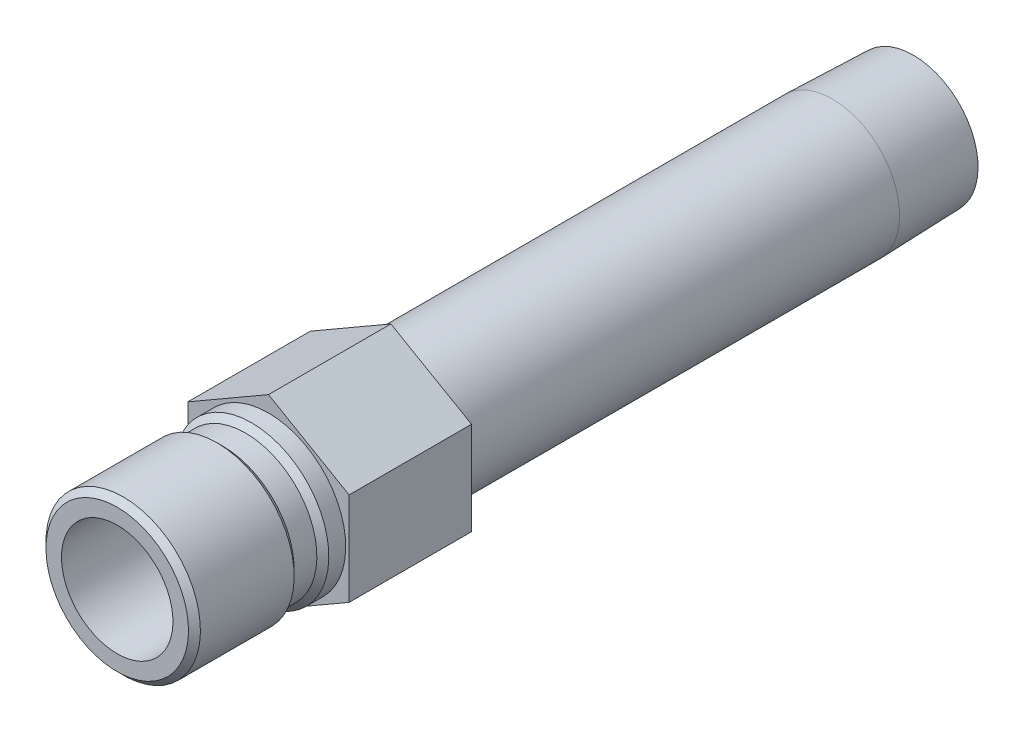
ISO-10303-21;
HEADER;
FILE_DESCRIPTION(('STEP AP214'),'2;1');
FILE_NAME('part.step','',(''),(''),'','','');
FILE_SCHEMA(('AUTOMOTIVE_DESIGN { 1 0 10303 214 1 1 1 1 }'));
ENDSEC;
DATA;
#1=APPLICATION_CONTEXT('core data for automotive mechanical design processes');
#2=APPLICATION_PROTOCOL_DEFINITION('international standard','automotive_design',2000,#1);
#3=PRODUCT_CONTEXT('',#1,'mechanical');
#4=PRODUCT('Part','Part','',(#3));
#5=PRODUCT_RELATED_PRODUCT_CATEGORY('part','',(#4));
#6=PRODUCT_DEFINITION_FORMATION('','',#4);
#7=PRODUCT_DEFINITION_CONTEXT('part definition',#1,'design');
#8=PRODUCT_DEFINITION('design','',#6,#7);
#9=PRODUCT_DEFINITION_SHAPE('','',#8);
#10=(LENGTH_UNIT() NAMED_UNIT(*) SI_UNIT(.MILLI.,.METRE.));
#11=(NAMED_UNIT(*) PLANE_ANGLE_UNIT() SI_UNIT($,.RADIAN.));
#12=(NAMED_UNIT(*) SI_UNIT($,.STERADIAN.) SOLID_ANGLE_UNIT());
#13=UNCERTAINTY_MEASURE_WITH_UNIT(LENGTH_MEASURE(1.E-05),#10,'distance_accuracy_value','');
#14=(GEOMETRIC_REPRESENTATION_CONTEXT(3) GLOBAL_UNCERTAINTY_ASSIGNED_CONTEXT((#13)) GLOBAL_UNIT_ASSIGNED_CONTEXT((#10,
#11,#12)) REPRESENTATION_CONTEXT('',''));
#15=CARTESIAN_POINT('',(0.,0.,0.));
#16=DIRECTION('',(0.,0.,1.));
#17=DIRECTION('',(1.,0.,0.));
#18=AXIS2_PLACEMENT_3D('',#15,#16,#17);
#19=CARTESIAN_POINT('',(0.,0.,0.));
#20=DIRECTION('',(0.,0.,-1.));
#21=DIRECTION('',(0.,1.,0.));
#22=AXIS2_PLACEMENT_3D('',#19,#20,#21);
#23=CYLINDRICAL_SURFACE('',#22,8.5725);
#24=CARTESIAN_POINT('',(0.,0.,-71.9582));
#25=DIRECTION('',(0.,0.,-1.));
#26=DIRECTION('',(0.,1.,0.));
#27=AXIS2_PLACEMENT_3D('',#24,#25,#26);
#28=CIRCLE('',#27,8.5725);
#29=CARTESIAN_POINT('',(0.,8.5725,-71.9582));
#30=VERTEX_POINT('',#29);
#31=EDGE_CURVE('E158',#30,#30,#28,.T.);
#32=ORIENTED_EDGE('',*,*,#31,.F.);
#33=EDGE_LOOP('',(#32));
#34=FACE_BOUND('',#33,.T.);
#35=CARTESIAN_POINT('',(0.,0.,-15.621));
#36=DIRECTION('',(0.,0.,1.));
#37=DIRECTION('',(1.,0.,0.));
#38=AXIS2_PLACEMENT_3D('',#35,#36,#37);
#39=CIRCLE('',#38,8.5725);
#40=CARTESIAN_POINT('',(8.5725,0.,-15.621));
#41=VERTEX_POINT('',#40);
#42=EDGE_CURVE('E39',#41,#41,#39,.F.);
#43=ORIENTED_EDGE('',*,*,#42,.T.);
#44=EDGE_LOOP('',(#43));
#45=FACE_BOUND('',#44,.T.);
#46=ADVANCED_FACE('F35',(#34,#45),#23,.T.);
#47=CARTESIAN_POINT('',(0.,0.,0.));
#48=DIRECTION('',(0.,0.,-1.));
#49=DIRECTION('',(0.,1.,0.));
#50=AXIS2_PLACEMENT_3D('',#47,#48,#49);
#51=CYLINDRICAL_SURFACE('',#50,7.112);
#52=CARTESIAN_POINT('',(0.,0.,1.524));
#53=DIRECTION('',(0.,0.,-1.));
#54=DIRECTION('',(0.,1.,0.));
#55=AXIS2_PLACEMENT_3D('',#52,#53,#54);
#56=CIRCLE('',#55,7.112);
#57=CARTESIAN_POINT('',(0.,7.112,1.524));
#58=VERTEX_POINT('',#57);
#59=EDGE_CURVE('E146',#58,#58,#56,.T.);
#60=ORIENTED_EDGE('',*,*,#59,.T.);
#61=EDGE_LOOP('',(#60));
#62=FACE_BOUND('',#61,.T.);
#63=CARTESIAN_POINT('',(0.,0.,19.304));
#64=DIRECTION('',(0.,0.,-1.));
#65=DIRECTION('',(0.,1.,0.));
#66=AXIS2_PLACEMENT_3D('',#63,#64,#65);
#67=CIRCLE('',#66,7.112);
#68=CARTESIAN_POINT('',(0.,7.112,19.304));
#69=VERTEX_POINT('',#68);
#70=EDGE_CURVE('E11',#69,#69,#67,.T.);
#71=ORIENTED_EDGE('',*,*,#70,.F.);
#72=EDGE_LOOP('',(#71));
#73=FACE_BOUND('',#72,.T.);
#74=ADVANCED_FACE('F37',(#62,#73),#51,.F.);
#75=CARTESIAN_POINT('',(0.,7.112,19.304));
#76=DIRECTION('',(0.,0.,1.));
#77=DIRECTION('',(0.,-1.,0.));
#78=AXIS2_PLACEMENT_3D('',#75,#76,#77);
#79=PLANE('',#78);
#80=ORIENTED_EDGE('',*,*,#70,.T.);
#81=EDGE_LOOP('',(#80));
#82=FACE_BOUND('',#81,.T.);
#83=CARTESIAN_POINT('',(0.,0.,19.304));
#84=DIRECTION('',(0.,0.,-1.));
#85=DIRECTION('',(0.,1.,0.));
#86=AXIS2_PLACEMENT_3D('',#83,#84,#85);
#87=CIRCLE('',#86,9.09319999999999);
#88=CARTESIAN_POINT('',(0.,9.0932,19.304));
#89=VERTEX_POINT('',#88);
#90=EDGE_CURVE('E45',#89,#89,#87,.T.);
#91=ORIENTED_EDGE('',*,*,#90,.F.);
#92=EDGE_LOOP('',(#91));
#93=FACE_BOUND('',#92,.T.);
#94=ADVANCED_FACE('F185',(#82,#93),#79,.T.);
#95=CARTESIAN_POINT('',(0.,0.,18.542));
#96=DIRECTION('',(0.,0.,-1.));
#97=DIRECTION('',(0.,1.,0.));
#98=AXIS2_PLACEMENT_3D('',#95,#96,#97);
#99=CONICAL_SURFACE('',#98,9.8552,0.785398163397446);
#100=ORIENTED_EDGE('',*,*,#90,.T.);
#101=EDGE_LOOP('',(#100));
#102=FACE_BOUND('',#101,.T.);
#103=CARTESIAN_POINT('',(0.,0.,18.542));
#104=DIRECTION('',(0.,0.,-1.));
#105=DIRECTION('',(0.,1.,0.));
#106=AXIS2_PLACEMENT_3D('',#103,#104,#105);
#107=CIRCLE('',#106,9.8552);
#108=CARTESIAN_POINT('',(0.,9.8552,18.542));
#109=VERTEX_POINT('',#108);
#110=EDGE_CURVE('E176',#109,#109,#107,.T.);
#111=ORIENTED_EDGE('',*,*,#110,.F.);
#112=EDGE_LOOP('',(#111));
#113=FACE_BOUND('',#112,.T.);
#114=ADVANCED_FACE('F182',(#102,#113),#99,.T.);
#115=CARTESIAN_POINT('',(0.,0.,0.));
#116=DIRECTION('',(0.,0.,-1.));
#117=DIRECTION('',(0.,1.,0.));
#118=AXIS2_PLACEMENT_3D('',#115,#116,#117);
#119=CYLINDRICAL_SURFACE('',#118,9.8552);
#120=ORIENTED_EDGE('',*,*,#110,.T.);
#121=EDGE_LOOP('',(#120));
#122=FACE_BOUND('',#121,.T.);
#123=CARTESIAN_POINT('',(0.,0.,6.5786));
#124=DIRECTION('',(0.,0.,-1.));
#125=DIRECTION('',(0.,1.,0.));
#126=AXIS2_PLACEMENT_3D('',#123,#124,#125);
#127=CIRCLE('',#126,9.8552);
#128=CARTESIAN_POINT('',(0.,9.8552,6.5786));
#129=VERTEX_POINT('',#128);
#130=EDGE_CURVE('E173',#129,#129,#127,.T.);
#131=ORIENTED_EDGE('',*,*,#130,.F.);
#132=EDGE_LOOP('',(#131));
#133=FACE_BOUND('',#132,.T.);
#134=ADVANCED_FACE('F192',(#122,#133),#119,.T.);
#135=CARTESIAN_POINT('',(0.,0.,5.8166));
#136=DIRECTION('',(0.,0.,1.));
#137=DIRECTION('',(0.,-1.,0.));
#138=AXIS2_PLACEMENT_3D('',#135,#136,#137);
#139=CONICAL_SURFACE('',#138,9.0932,0.785398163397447);
#140=ORIENTED_EDGE('',*,*,#130,.T.);
#141=EDGE_LOOP('',(#140));
#142=FACE_BOUND('',#141,.T.);
#143=CARTESIAN_POINT('',(0.,0.,5.8166));
#144=DIRECTION('',(0.,0.,-1.));
#145=DIRECTION('',(0.,1.,0.));
#146=AXIS2_PLACEMENT_3D('',#143,#144,#145);
#147=CIRCLE('',#146,9.0932);
#148=CARTESIAN_POINT('',(0.,9.0932,5.8166));
#149=VERTEX_POINT('',#148);
#150=EDGE_CURVE('E170',#149,#149,#147,.T.);
#151=ORIENTED_EDGE('',*,*,#150,.F.);
#152=EDGE_LOOP('',(#151));
#153=FACE_BOUND('',#152,.T.);
#154=ADVANCED_FACE('F217',(#142,#153),#139,.T.);
#155=CARTESIAN_POINT('',(0.,0.,0.));
#156=DIRECTION('',(0.,0.,-1.));
#157=DIRECTION('',(0.,1.,0.));
#158=AXIS2_PLACEMENT_3D('',#155,#156,#157);
#159=CYLINDRICAL_SURFACE('',#158,9.0932);
#160=ORIENTED_EDGE('',*,*,#150,.T.);
#161=EDGE_LOOP('',(#160));
#162=FACE_BOUND('',#161,.T.);
#163=CARTESIAN_POINT('',(0.,0.,2.921));
#164=DIRECTION('',(0.,0.,-1.));
#165=DIRECTION('',(0.,1.,0.));
#166=AXIS2_PLACEMENT_3D('',#163,#164,#165);
#167=CIRCLE('',#166,9.0932);
#168=CARTESIAN_POINT('',(0.,9.0932,2.921));
#169=VERTEX_POINT('',#168);
#170=EDGE_CURVE('E167',#169,#169,#167,.T.);
#171=ORIENTED_EDGE('',*,*,#170,.F.);
#172=EDGE_LOOP('',(#171));
#173=FACE_BOUND('',#172,.T.);
#174=ADVANCED_FACE('F213',(#162,#173),#159,.T.);
#175=CARTESIAN_POINT('',(0.,0.,2.159));
#176=DIRECTION('',(0.,0.,-1.));
#177=DIRECTION('',(0.,1.,0.));
#178=AXIS2_PLACEMENT_3D('',#175,#176,#177);
#179=CONICAL_SURFACE('',#178,9.8552,0.785398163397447);
#180=ORIENTED_EDGE('',*,*,#170,.T.);
#181=EDGE_LOOP('',(#180));
#182=FACE_BOUND('',#181,.T.);
#183=CARTESIAN_POINT('',(0.,0.,2.159));
#184=DIRECTION('',(0.,0.,-1.));
#185=DIRECTION('',(0.,1.,0.));
#186=AXIS2_PLACEMENT_3D('',#183,#184,#185);
#187=CIRCLE('',#186,9.8552);
#188=CARTESIAN_POINT('',(0.,9.8552,2.159));
#189=VERTEX_POINT('',#188);
#190=EDGE_CURVE('E164',#189,#189,#187,.T.);
#191=ORIENTED_EDGE('',*,*,#190,.F.);
#192=EDGE_LOOP('',(#191));
#193=FACE_BOUND('',#192,.T.);
#194=ADVANCED_FACE('F209',(#182,#193),#179,.T.);
#195=CARTESIAN_POINT('',(0.,0.,0.));
#196=DIRECTION('',(0.,0.,-1.));
#197=DIRECTION('',(0.,1.,0.));
#198=AXIS2_PLACEMENT_3D('',#195,#196,#197);
#199=CYLINDRICAL_SURFACE('',#198,9.8552);
#200=ORIENTED_EDGE('',*,*,#190,.T.);
#201=EDGE_LOOP('',(#200));
#202=FACE_BOUND('',#201,.T.);
#203=CARTESIAN_POINT('',(0.,0.,0.));
#204=DIRECTION('',(0.,0.,-1.));
#205=DIRECTION('',(0.,1.,0.));
#206=AXIS2_PLACEMENT_3D('',#203,#204,#205);
#207=CIRCLE('',#206,9.8552);
#208=CARTESIAN_POINT('',(0.,9.8552,0.));
#209=VERTEX_POINT('',#208);
#210=EDGE_CURVE('E161',#209,#209,#207,.T.);
#211=ORIENTED_EDGE('',*,*,#210,.F.);
#212=EDGE_LOOP('',(#211));
#213=FACE_BOUND('',#212,.T.);
#214=ADVANCED_FACE('F206',(#202,#213),#199,.T.);
#215=CARTESIAN_POINT('',(0.,0.,-82.296));
#216=DIRECTION('',(0.,0.,1.));
#217=DIRECTION('',(0.,-1.,0.));
#218=AXIS2_PLACEMENT_3D('',#215,#216,#217);
#219=CONICAL_SURFACE('',#218,8.24944566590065,0.0312396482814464);
#220=ORIENTED_EDGE('',*,*,#31,.T.);
#221=EDGE_LOOP('',(#220));
#222=FACE_BOUND('',#221,.T.);
#223=CARTESIAN_POINT('',(0.,0.,-82.296));
#224=DIRECTION('',(0.,0.,-1.));
#225=DIRECTION('',(0.,1.,0.));
#226=AXIS2_PLACEMENT_3D('',#223,#224,#225);
#227=CIRCLE('',#226,8.24944566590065);
#228=CARTESIAN_POINT('',(0.,8.24944566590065,-82.296));
#229=VERTEX_POINT('',#228);
#230=EDGE_CURVE('E155',#229,#229,#227,.T.);
#231=ORIENTED_EDGE('',*,*,#230,.F.);
#232=EDGE_LOOP('',(#231));
#233=FACE_BOUND('',#232,.T.);
#234=ADVANCED_FACE('F204',(#222,#233),#219,.T.);
#235=CARTESIAN_POINT('',(0.,8.24944566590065,-82.296));
#236=DIRECTION('',(0.,0.,-1.));
#237=DIRECTION('',(0.,1.,0.));
#238=AXIS2_PLACEMENT_3D('',#235,#236,#237);
#239=PLANE('',#238);
#240=ORIENTED_EDGE('',*,*,#230,.T.);
#241=EDGE_LOOP('',(#240));
#242=FACE_BOUND('',#241,.T.);
#243=CARTESIAN_POINT('',(0.,0.,-82.296));
#244=DIRECTION('',(0.,0.,-1.));
#245=DIRECTION('',(0.,1.,0.));
#246=AXIS2_PLACEMENT_3D('',#243,#244,#245);
#247=CIRCLE('',#246,6.2611);
#248=CARTESIAN_POINT('',(0.,6.2611,-82.296));
#249=VERTEX_POINT('',#248);
#250=EDGE_CURVE('E152',#249,#249,#247,.T.);
#251=ORIENTED_EDGE('',*,*,#250,.F.);
#252=EDGE_LOOP('',(#251));
#253=FACE_BOUND('',#252,.T.);
#254=ADVANCED_FACE('F270',(#242,#253),#239,.T.);
#255=CARTESIAN_POINT('',(0.,0.,0.));
#256=DIRECTION('',(0.,0.,-1.));
#257=DIRECTION('',(0.,1.,0.));
#258=AXIS2_PLACEMENT_3D('',#255,#256,#257);
#259=CYLINDRICAL_SURFACE('',#258,6.2611);
#260=ORIENTED_EDGE('',*,*,#250,.T.);
#261=EDGE_LOOP('',(#260));
#262=FACE_BOUND('',#261,.T.);
#263=CARTESIAN_POINT('',(0.,0.,1.07156844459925));
#264=DIRECTION('',(0.,0.,-1.));
#265=DIRECTION('',(0.,1.,0.));
#266=AXIS2_PLACEMENT_3D('',#263,#264,#265);
#267=CIRCLE('',#266,6.2611);
#268=CARTESIAN_POINT('',(0.,6.2611,1.07156844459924));
#269=VERTEX_POINT('',#268);
#270=EDGE_CURVE('E149',#269,#269,#267,.T.);
#271=ORIENTED_EDGE('',*,*,#270,.F.);
#272=EDGE_LOOP('',(#271));
#273=FACE_BOUND('',#272,.T.);
#274=ADVANCED_FACE('F267',(#262,#273),#259,.F.);
#275=CARTESIAN_POINT('',(0.,0.,1.524));
#276=DIRECTION('',(0.,0.,1.));
#277=DIRECTION('',(0.,-1.,0.));
#278=AXIS2_PLACEMENT_3D('',#275,#276,#277);
#279=CONICAL_SURFACE('',#278,7.112,1.08210413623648);
#280=ORIENTED_EDGE('',*,*,#270,.T.);
#281=EDGE_LOOP('',(#280));
#282=FACE_BOUND('',#281,.T.);
#283=ORIENTED_EDGE('',*,*,#59,.F.);
#284=EDGE_LOOP('',(#283));
#285=FACE_BOUND('',#284,.T.);
#286=ADVANCED_FACE('F255',(#282,#285),#279,.F.);
#287=CARTESIAN_POINT('',(0.,11.8784044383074,-15.621));
#288=DIRECTION('',(-0.5,0.866025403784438,0.));
#289=DIRECTION('',(-0.866025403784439,-0.5,0.));
#290=AXIS2_PLACEMENT_3D('',#287,#288,#289);
#291=PLANE('',#290);
#292=DIRECTION('',(-0.866025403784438,-0.5,0.));
#293=VECTOR('',#292,1.);
#294=CARTESIAN_POINT('',(0.,11.8784044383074,0.));
#295=LINE('',#294,#293);
#296=CARTESIAN_POINT('',(0.,11.8784044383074,0.));
#297=VERTEX_POINT('',#296);
#298=CARTESIAN_POINT('',(-10.287,5.93920221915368,0.));
#299=VERTEX_POINT('',#298);
#300=EDGE_CURVE('E124',#297,#299,#295,.T.);
#301=ORIENTED_EDGE('',*,*,#300,.F.);
#302=DIRECTION('',(0.,0.,1.));
#303=VECTOR('',#302,1.);
#304=CARTESIAN_POINT('',(0.,11.8784044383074,-15.621));
#305=LINE('',#304,#303);
#306=CARTESIAN_POINT('',(0.,11.8784044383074,-15.621));
#307=VERTEX_POINT('',#306);
#308=EDGE_CURVE('E53',#307,#297,#305,.T.);
#309=ORIENTED_EDGE('',*,*,#308,.F.);
#310=DIRECTION('',(-0.866025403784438,-0.5,0.));
#311=VECTOR('',#310,1.);
#312=CARTESIAN_POINT('',(0.,11.8784044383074,-15.621));
#313=LINE('',#312,#311);
#314=CARTESIAN_POINT('',(-10.287,5.93920221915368,-15.621));
#315=VERTEX_POINT('',#314);
#316=EDGE_CURVE('E139',#307,#315,#313,.T.);
#317=ORIENTED_EDGE('',*,*,#316,.T.);
#318=DIRECTION('',(0.,0.,1.));
#319=VECTOR('',#318,1.);
#320=CARTESIAN_POINT('',(-10.287,5.93920221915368,-15.621));
#321=LINE('',#320,#319);
#322=EDGE_CURVE('E88',#315,#299,#321,.T.);
#323=ORIENTED_EDGE('',*,*,#322,.T.);
#324=EDGE_LOOP('',(#301,#309,#317,#323));
#325=FACE_BOUND('',#324,.T.);
#326=ADVANCED_FACE('F242',(#325),#291,.T.);
#327=CARTESIAN_POINT('',(10.287,5.93920221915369,-15.621));
#328=DIRECTION('',(0.5,0.866025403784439,0.));
#329=DIRECTION('',(-0.866025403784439,0.5,0.));
#330=AXIS2_PLACEMENT_3D('',#327,#328,#329);
#331=PLANE('',#330);
#332=DIRECTION('',(-0.866025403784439,0.5,0.));
#333=VECTOR('',#332,1.);
#334=CARTESIAN_POINT('',(10.287,5.93920221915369,0.));
#335=LINE('',#334,#333);
#336=CARTESIAN_POINT('',(10.287,5.93920221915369,0.));
#337=VERTEX_POINT('',#336);
#338=EDGE_CURVE('E136',#337,#297,#335,.T.);
#339=ORIENTED_EDGE('',*,*,#338,.F.);
#340=DIRECTION('',(0.,0.,1.));
#341=VECTOR('',#340,1.);
#342=CARTESIAN_POINT('',(10.287,5.93920221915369,-15.621));
#343=LINE('',#342,#341);
#344=CARTESIAN_POINT('',(10.287,5.93920221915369,-15.621));
#345=VERTEX_POINT('',#344);
#346=EDGE_CURVE('E76',#345,#337,#343,.T.);
#347=ORIENTED_EDGE('',*,*,#346,.F.);
#348=DIRECTION('',(-0.866025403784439,0.5,0.));
#349=VECTOR('',#348,1.);
#350=CARTESIAN_POINT('',(10.287,5.93920221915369,-15.621));
#351=LINE('',#350,#349);
#352=EDGE_CURVE('E114',#345,#307,#351,.T.);
#353=ORIENTED_EDGE('',*,*,#352,.T.);
#354=ORIENTED_EDGE('',*,*,#308,.T.);
#355=EDGE_LOOP('',(#339,#347,#353,#354));
#356=FACE_BOUND('',#355,.T.);
#357=ADVANCED_FACE('F247',(#356),#331,.T.);
#358=CARTESIAN_POINT('',(10.287,-5.93920221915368,-15.621));
#359=DIRECTION('',(1.,0.,0.));
#360=DIRECTION('',(0.,0.,-1.));
#361=AXIS2_PLACEMENT_3D('',#358,#359,#360);
#362=PLANE('',#361);
#363=DIRECTION('',(0.,1.,0.));
#364=VECTOR('',#363,1.);
#365=CARTESIAN_POINT('',(10.287,-5.93920221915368,0.));
#366=LINE('',#365,#364);
#367=CARTESIAN_POINT('',(10.287,-5.93920221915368,0.));
#368=VERTEX_POINT('',#367);
#369=EDGE_CURVE('E101',#368,#337,#366,.T.);
#370=ORIENTED_EDGE('',*,*,#369,.F.);
#371=DIRECTION('',(0.,0.,1.));
#372=VECTOR('',#371,1.);
#373=CARTESIAN_POINT('',(10.287,-5.93920221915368,-15.621));
#374=LINE('',#373,#372);
#375=CARTESIAN_POINT('',(10.287,-5.93920221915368,-15.621));
#376=VERTEX_POINT('',#375);
#377=EDGE_CURVE('E96',#376,#368,#374,.T.);
#378=ORIENTED_EDGE('',*,*,#377,.F.);
#379=DIRECTION('',(0.,1.,0.));
#380=VECTOR('',#379,1.);
#381=CARTESIAN_POINT('',(10.287,-5.93920221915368,-15.621));
#382=LINE('',#381,#380);
#383=EDGE_CURVE('E99',#376,#345,#382,.T.);
#384=ORIENTED_EDGE('',*,*,#383,.T.);
#385=ORIENTED_EDGE('',*,*,#346,.T.);
#386=EDGE_LOOP('',(#370,#378,#384,#385));
#387=FACE_BOUND('',#386,.T.);
#388=ADVANCED_FACE('F98',(#387),#362,.T.);
#389=CARTESIAN_POINT('',(0.,-11.8784044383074,-15.621));
#390=DIRECTION('',(0.5,-0.866025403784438,0.));
#391=DIRECTION('',(0.866025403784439,0.5,0.));
#392=AXIS2_PLACEMENT_3D('',#389,#390,#391);
#393=PLANE('',#392);
#394=DIRECTION('',(0.866025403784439,0.5,0.));
#395=VECTOR('',#394,1.);
#396=CARTESIAN_POINT('',(0.,-11.8784044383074,0.));
#397=LINE('',#396,#395);
#398=CARTESIAN_POINT('',(0.,-11.8784044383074,0.));
#399=VERTEX_POINT('',#398);
#400=EDGE_CURVE('E133',#399,#368,#397,.T.);
#401=ORIENTED_EDGE('',*,*,#400,.F.);
#402=DIRECTION('',(0.,0.,1.));
#403=VECTOR('',#402,1.);
#404=CARTESIAN_POINT('',(0.,-11.8784044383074,-15.621));
#405=LINE('',#404,#403);
#406=CARTESIAN_POINT('',(0.,-11.8784044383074,-15.621));
#407=VERTEX_POINT('',#406);
#408=EDGE_CURVE('E106',#407,#399,#405,.T.);
#409=ORIENTED_EDGE('',*,*,#408,.F.);
#410=DIRECTION('',(0.866025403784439,0.5,0.));
#411=VECTOR('',#410,1.);
#412=CARTESIAN_POINT('',(0.,-11.8784044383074,-15.621));
#413=LINE('',#412,#411);
#414=EDGE_CURVE('E112',#407,#376,#413,.T.);
#415=ORIENTED_EDGE('',*,*,#414,.T.);
#416=ORIENTED_EDGE('',*,*,#377,.T.);
#417=EDGE_LOOP('',(#401,#409,#415,#416));
#418=FACE_BOUND('',#417,.T.);
#419=ADVANCED_FACE('F116',(#418),#393,.T.);
#420=CARTESIAN_POINT('',(-10.287,-5.93920221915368,-15.621));
#421=DIRECTION('',(-0.5,-0.866025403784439,0.));
#422=DIRECTION('',(0.866025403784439,-0.5,0.));
#423=AXIS2_PLACEMENT_3D('',#420,#421,#422);
#424=PLANE('',#423);
#425=DIRECTION('',(0.866025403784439,-0.5,0.));
#426=VECTOR('',#425,1.);
#427=CARTESIAN_POINT('',(-10.287,-5.93920221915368,0.));
#428=LINE('',#427,#426);
#429=CARTESIAN_POINT('',(-10.287,-5.93920221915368,0.));
#430=VERTEX_POINT('',#429);
#431=EDGE_CURVE('E130',#430,#399,#428,.T.);
#432=ORIENTED_EDGE('',*,*,#431,.F.);
#433=DIRECTION('',(0.,0.,1.));
#434=VECTOR('',#433,1.);
#435=CARTESIAN_POINT('',(-10.287,-5.93920221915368,-15.621));
#436=LINE('',#435,#434);
#437=CARTESIAN_POINT('',(-10.287,-5.93920221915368,-15.621));
#438=VERTEX_POINT('',#437);
#439=EDGE_CURVE('E143',#438,#430,#436,.T.);
#440=ORIENTED_EDGE('',*,*,#439,.F.);
#441=DIRECTION('',(0.866025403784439,-0.5,0.));
#442=VECTOR('',#441,1.);
#443=CARTESIAN_POINT('',(-10.287,-5.93920221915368,-15.621));
#444=LINE('',#443,#442);
#445=EDGE_CURVE('E117',#438,#407,#444,.T.);
#446=ORIENTED_EDGE('',*,*,#445,.T.);
#447=ORIENTED_EDGE('',*,*,#408,.T.);
#448=EDGE_LOOP('',(#432,#440,#446,#447));
#449=FACE_BOUND('',#448,.T.);
#450=ADVANCED_FACE('F246',(#449),#424,.T.);
#451=CARTESIAN_POINT('',(-10.287,5.93920221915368,-15.621));
#452=DIRECTION('',(-1.,0.,0.));
#453=DIRECTION('',(0.,0.,1.));
#454=AXIS2_PLACEMENT_3D('',#451,#452,#453);
#455=PLANE('',#454);
#456=DIRECTION('',(0.,-1.,0.));
#457=VECTOR('',#456,1.);
#458=CARTESIAN_POINT('',(-10.287,5.93920221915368,0.));
#459=LINE('',#458,#457);
#460=EDGE_CURVE('E127',#299,#430,#459,.T.);
#461=ORIENTED_EDGE('',*,*,#460,.F.);
#462=ORIENTED_EDGE('',*,*,#322,.F.);
#463=DIRECTION('',(0.,-1.,0.));
#464=VECTOR('',#463,1.);
#465=CARTESIAN_POINT('',(-10.287,5.93920221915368,-15.621));
#466=LINE('',#465,#464);
#467=EDGE_CURVE('E119',#315,#438,#466,.T.);
#468=ORIENTED_EDGE('',*,*,#467,.T.);
#469=ORIENTED_EDGE('',*,*,#439,.T.);
#470=EDGE_LOOP('',(#461,#462,#468,#469));
#471=FACE_BOUND('',#470,.T.);
#472=ADVANCED_FACE('F243',(#471),#455,.T.);
#473=CARTESIAN_POINT('',(-10.287,5.93920221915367,-15.621));
#474=DIRECTION('',(0.,0.,1.));
#475=DIRECTION('',(1.,0.,0.));
#476=AXIS2_PLACEMENT_3D('',#473,#474,#475);
#477=PLANE('',#476);
#478=ORIENTED_EDGE('',*,*,#42,.F.);
#479=EDGE_LOOP('',(#478));
#480=FACE_BOUND('',#479,.T.);
#481=ORIENTED_EDGE('',*,*,#316,.F.);
#482=ORIENTED_EDGE('',*,*,#352,.F.);
#483=ORIENTED_EDGE('',*,*,#383,.F.);
#484=ORIENTED_EDGE('',*,*,#414,.F.);
#485=ORIENTED_EDGE('',*,*,#445,.F.);
#486=ORIENTED_EDGE('',*,*,#467,.F.);
#487=EDGE_LOOP('',(#481,#482,#483,#484,#485,#486));
#488=FACE_BOUND('',#487,.T.);
#489=ADVANCED_FACE('F110',(#480,#488),#477,.F.);
#490=CARTESIAN_POINT('',(-10.287,5.93920221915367,0.));
#491=DIRECTION('',(0.,0.,1.));
#492=DIRECTION('',(1.,0.,0.));
#493=AXIS2_PLACEMENT_3D('',#490,#491,#492);
#494=PLANE('',#493);
#495=ORIENTED_EDGE('',*,*,#210,.T.);
#496=EDGE_LOOP('',(#495));
#497=FACE_BOUND('',#496,.T.);
#498=ORIENTED_EDGE('',*,*,#300,.T.);
#499=ORIENTED_EDGE('',*,*,#460,.T.);
#500=ORIENTED_EDGE('',*,*,#431,.T.);
#501=ORIENTED_EDGE('',*,*,#400,.T.);
#502=ORIENTED_EDGE('',*,*,#369,.T.);
#503=ORIENTED_EDGE('',*,*,#338,.T.);
#504=EDGE_LOOP('',(#498,#499,#500,#501,#502,#503));
#505=FACE_BOUND('',#504,.T.);
#506=ADVANCED_FACE('F238',(#497,#505),#494,.T.);
#507=CLOSED_SHELL('',(#46,#74,#94,#114,#134,#154,#174,#194,#214,#234,#254,#274,#286,#326,#357,
#388,#419,#450,#472,#489,#506));
#508=MANIFOLD_SOLID_BREP('B2',#507);
#509=ADVANCED_BREP_SHAPE_REPRESENTATION('',(#18,#508),#14);
#510=SHAPE_DEFINITION_REPRESENTATION(#9,#509);
ENDSEC;
END-ISO-10303-21;
